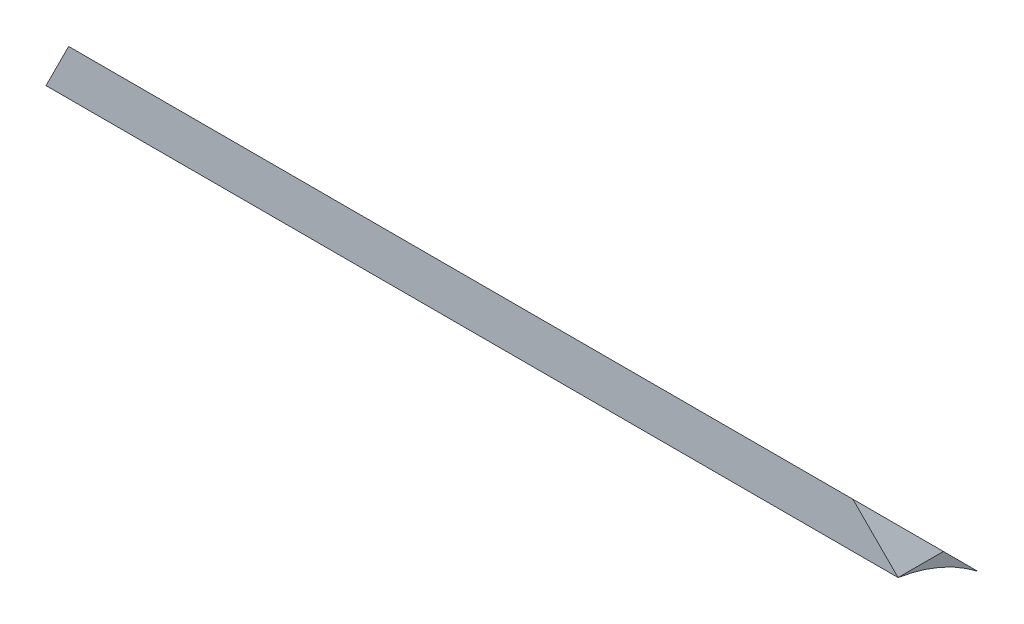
from build123d import *

# Parameters (mm, degrees)
SKETCH1_W          = 101.6
SKETCH1_H          = 12.7
EXTRUDE1_DEPTH     = 12.7
CUT_EXTRUDE1_DEPTH = 104.175287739
CUT_EXTRUDE2_DEPTH = 104.175287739
SKETCH5_OUTSIDE_W  = 124.098
SKETCH5_OUTSIDE_H  = 32.023
CUT_EXTRUDE6_DEPTH = 103.832755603


with BuildPart() as part:
    # Sketch1 → Extrude1 (new body)
    with BuildSketch(Plane(origin=(0, 0, 0), x_dir=(1, 0, 0), z_dir=(0, 1, 0))):
        with Locations((50.8, 6.35)):
            Rectangle(SKETCH1_W, SKETCH1_H)
    extrude(amount=EXTRUDE1_DEPTH)

    # Sketch2 → Cut-Extrude1 (cut, through all)
    with BuildSketch(Plane(origin=(101.6, 0, 0), x_dir=(0, 0, -1), z_dir=(1, 0, 0))):
        Polygon((0, 12.7), (12.7, 0), (12.7, 12.7), align=None)
    extrude(amount=-CUT_EXTRUDE1_DEPTH, mode=Mode.SUBTRACT)

    # Sketch3 → Cut-Extrude2 (cut, through all)
    with BuildSketch(Plane(origin=(101.6, 0, 0), x_dir=(0, 0, -1), z_dir=(1, 0, 0))):
        with BuildLine():
            Line((0, 4.370465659), (0, 19.320393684))
            Line((0, 19.320393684), (3.175, 19.320393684))
            Line((3.175, 19.320393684), (3.175, 4.124772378))
            ThreePointArc((3.175, 4.124772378), (-1.59224607, -36.843019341), (0, 4.370465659))
        make_face()
    extrude(amount=-CUT_EXTRUDE2_DEPTH, mode=Mode.SUBTRACT)

    # Sketch5 outside → Cut-Extrude6 (cut, through all)
    with BuildSketch(Plane.XY):
        with Locations((50.8, 4.7625)):
            Rectangle(SKETCH5_OUTSIDE_W, SKETCH5_OUTSIDE_H)
        Polygon((101.6, 0), (101.6, 4.124772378), (50.8, 54.924772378), (25.4, 54.924772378), (0, 4.124772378), (0, 0), align=None, mode=Mode.SUBTRACT)
    extrude(amount=-CUT_EXTRUDE6_DEPTH, mode=Mode.SUBTRACT)


solid = part.part
